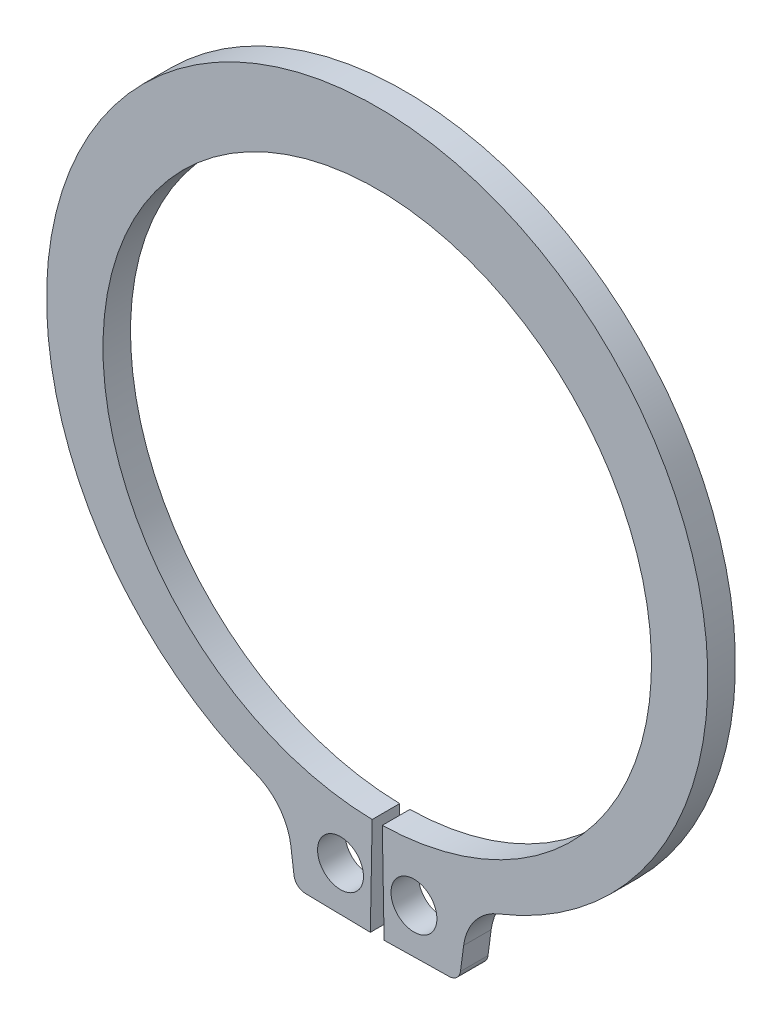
ISO-10303-21;
HEADER;
FILE_DESCRIPTION(('STEP AP214'),'2;1');
FILE_NAME('part.step','',(''),(''),'','','');
FILE_SCHEMA(('AUTOMOTIVE_DESIGN { 1 0 10303 214 1 1 1 1 }'));
ENDSEC;
DATA;
#1=APPLICATION_CONTEXT('core data for automotive mechanical design processes');
#2=APPLICATION_PROTOCOL_DEFINITION('international standard','automotive_design',2000,#1);
#3=PRODUCT_CONTEXT('',#1,'mechanical');
#4=PRODUCT('Part','Part','',(#3));
#5=PRODUCT_RELATED_PRODUCT_CATEGORY('part','',(#4));
#6=PRODUCT_DEFINITION_FORMATION('','',#4);
#7=PRODUCT_DEFINITION_CONTEXT('part definition',#1,'design');
#8=PRODUCT_DEFINITION('design','',#6,#7);
#9=PRODUCT_DEFINITION_SHAPE('','',#8);
#10=(LENGTH_UNIT() NAMED_UNIT(*) SI_UNIT(.MILLI.,.METRE.));
#11=(NAMED_UNIT(*) PLANE_ANGLE_UNIT() SI_UNIT($,.RADIAN.));
#12=(NAMED_UNIT(*) SI_UNIT($,.STERADIAN.) SOLID_ANGLE_UNIT());
#13=UNCERTAINTY_MEASURE_WITH_UNIT(LENGTH_MEASURE(1.E-05),#10,'distance_accuracy_value','');
#14=(GEOMETRIC_REPRESENTATION_CONTEXT(3) GLOBAL_UNCERTAINTY_ASSIGNED_CONTEXT((#13)) GLOBAL_UNIT_ASSIGNED_CONTEXT((#10,
#11,#12)) REPRESENTATION_CONTEXT('',''));
#15=CARTESIAN_POINT('',(0.,0.,0.));
#16=DIRECTION('',(0.,0.,1.));
#17=DIRECTION('',(1.,0.,0.));
#18=AXIS2_PLACEMENT_3D('',#15,#16,#17);
#19=CARTESIAN_POINT('',(0.,0.,-1.2));
#20=DIRECTION('',(0.,0.,1.));
#21=DIRECTION('',(1.,0.,0.));
#22=AXIS2_PLACEMENT_3D('',#19,#20,#21);
#23=CYLINDRICAL_SURFACE('',#22,11.95);
#24=CARTESIAN_POINT('',(0.,0.,0.));
#25=DIRECTION('',(0.,0.,-1.));
#26=DIRECTION('',(1.,0.,0.));
#27=AXIS2_PLACEMENT_3D('',#24,#25,#26);
#28=CIRCLE('',#27,11.95);
#29=CARTESIAN_POINT('',(-0.220615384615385,-11.9479633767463,0.));
#30=VERTEX_POINT('',#29);
#31=CARTESIAN_POINT('',(0.220615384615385,-11.9479633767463,0.));
#32=VERTEX_POINT('',#31);
#33=EDGE_CURVE('E151',#30,#32,#28,.T.);
#34=ORIENTED_EDGE('',*,*,#33,.F.);
#35=DIRECTION('',(0.,0.,1.));
#36=VECTOR('',#35,1.);
#37=CARTESIAN_POINT('',(-0.220615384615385,-11.9479633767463,-1.2));
#38=LINE('',#37,#36);
#39=CARTESIAN_POINT('',(-0.220615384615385,-11.9479633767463,-1.2));
#40=VERTEX_POINT('',#39);
#41=EDGE_CURVE('E11',#40,#30,#38,.T.);
#42=ORIENTED_EDGE('',*,*,#41,.F.);
#43=CARTESIAN_POINT('',(0.,0.,-1.2));
#44=DIRECTION('',(0.,0.,-1.));
#45=DIRECTION('',(1.,0.,0.));
#46=AXIS2_PLACEMENT_3D('',#43,#44,#45);
#47=CIRCLE('',#46,11.95);
#48=CARTESIAN_POINT('',(0.220615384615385,-11.9479633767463,-1.2));
#49=VERTEX_POINT('',#48);
#50=EDGE_CURVE('E184',#40,#49,#47,.T.);
#51=ORIENTED_EDGE('',*,*,#50,.T.);
#52=DIRECTION('',(0.,0.,1.));
#53=VECTOR('',#52,1.);
#54=CARTESIAN_POINT('',(0.220615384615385,-11.9479633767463,-1.2));
#55=LINE('',#54,#53);
#56=EDGE_CURVE('E33',#49,#32,#55,.T.);
#57=ORIENTED_EDGE('',*,*,#56,.T.);
#58=EDGE_LOOP('',(#34,#42,#51,#57));
#59=FACE_BOUND('',#58,.T.);
#60=ADVANCED_FACE('F30',(#59),#23,.F.);
#61=CARTESIAN_POINT('',(-0.220615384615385,-11.9479633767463,-1.2));
#62=DIRECTION('',(0.999829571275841,-0.0184615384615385,0.));
#63=DIRECTION('',(0.0184615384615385,0.999829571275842,0.));
#64=AXIS2_PLACEMENT_3D('',#61,#62,#63);
#65=PLANE('',#64);
#66=DIRECTION('',(0.0184615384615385,0.999829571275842,0.));
#67=VECTOR('',#66,1.);
#68=CARTESIAN_POINT('',(-0.220615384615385,-11.9479633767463,0.));
#69=LINE('',#68,#67);
#70=CARTESIAN_POINT('',(-0.3,-16.2472305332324,0.));
#71=VERTEX_POINT('',#70);
#72=EDGE_CURVE('E182',#71,#30,#69,.T.);
#73=ORIENTED_EDGE('',*,*,#72,.F.);
#74=DIRECTION('',(0.,0.,1.));
#75=VECTOR('',#74,1.);
#76=CARTESIAN_POINT('',(-0.3,-16.2472305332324,-1.2));
#77=LINE('',#76,#75);
#78=CARTESIAN_POINT('',(-0.3,-16.2472305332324,-1.2));
#79=VERTEX_POINT('',#78);
#80=EDGE_CURVE('E39',#79,#71,#77,.T.);
#81=ORIENTED_EDGE('',*,*,#80,.F.);
#82=DIRECTION('',(0.0184615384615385,0.999829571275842,0.));
#83=VECTOR('',#82,1.);
#84=CARTESIAN_POINT('',(-0.220615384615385,-11.9479633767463,-1.2));
#85=LINE('',#84,#83);
#86=EDGE_CURVE('E141',#79,#40,#85,.T.);
#87=ORIENTED_EDGE('',*,*,#86,.T.);
#88=ORIENTED_EDGE('',*,*,#41,.T.);
#89=EDGE_LOOP('',(#73,#81,#87,#88));
#90=FACE_BOUND('',#89,.T.);
#91=ADVANCED_FACE('F204',(#90),#65,.T.);
#92=CARTESIAN_POINT('',(-0.3,-16.2472305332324,-1.2));
#93=DIRECTION('',(-0.0184615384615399,-0.999829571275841,0.));
#94=DIRECTION('',(0.999829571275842,-0.0184615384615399,0.));
#95=AXIS2_PLACEMENT_3D('',#92,#93,#94);
#96=PLANE('',#95);
#97=DIRECTION('',(0.999829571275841,-0.0184615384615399,0.));
#98=VECTOR('',#97,1.);
#99=CARTESIAN_POINT('',(-0.3,-16.2472305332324,0.));
#100=LINE('',#99,#98);
#101=CARTESIAN_POINT('',(-3.13998163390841,-16.1947911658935,0.));
#102=VERTEX_POINT('',#101);
#103=EDGE_CURVE('E128',#102,#71,#100,.T.);
#104=ORIENTED_EDGE('',*,*,#103,.F.);
#105=DIRECTION('',(0.,0.,1.));
#106=VECTOR('',#105,1.);
#107=CARTESIAN_POINT('',(-3.13998163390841,-16.1947911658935,-1.2));
#108=LINE('',#107,#106);
#109=CARTESIAN_POINT('',(-3.13998163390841,-16.1947911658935,-1.2));
#110=VERTEX_POINT('',#109);
#111=EDGE_CURVE('E123',#110,#102,#108,.T.);
#112=ORIENTED_EDGE('',*,*,#111,.F.);
#113=DIRECTION('',(0.999829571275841,-0.0184615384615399,0.));
#114=VECTOR('',#113,1.);
#115=CARTESIAN_POINT('',(-0.3,-16.2472305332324,-1.2));
#116=LINE('',#115,#114);
#117=EDGE_CURVE('E126',#110,#79,#116,.T.);
#118=ORIENTED_EDGE('',*,*,#117,.T.);
#119=ORIENTED_EDGE('',*,*,#80,.T.);
#120=EDGE_LOOP('',(#104,#112,#118,#119));
#121=FACE_BOUND('',#120,.T.);
#122=ADVANCED_FACE('F125',(#121),#96,.T.);
#123=CARTESIAN_POINT('',(-3.13075086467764,-15.6948763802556,-1.2));
#124=DIRECTION('',(0.,0.,1.));
#125=DIRECTION('',(1.,0.,0.));
#126=AXIS2_PLACEMENT_3D('',#123,#124,#125);
#127=CYLINDRICAL_SURFACE('',#126,0.499999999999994);
#128=CARTESIAN_POINT('',(-3.13075086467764,-15.6948763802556,0.));
#129=DIRECTION('',(0.,0.,1.));
#130=DIRECTION('',(1.,0.,0.));
#131=AXIS2_PLACEMENT_3D('',#128,#129,#130);
#132=CIRCLE('',#131,0.499999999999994);
#133=CARTESIAN_POINT('',(-3.62647329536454,-15.7601394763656,0.));
#134=VERTEX_POINT('',#133);
#135=EDGE_CURVE('E179',#134,#102,#132,.T.);
#136=ORIENTED_EDGE('',*,*,#135,.F.);
#137=DIRECTION('',(0.,0.,1.));
#138=VECTOR('',#137,1.);
#139=CARTESIAN_POINT('',(-3.62647329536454,-15.7601394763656,-1.2));
#140=LINE('',#139,#138);
#141=CARTESIAN_POINT('',(-3.62647329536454,-15.7601394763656,-1.2));
#142=VERTEX_POINT('',#141);
#143=EDGE_CURVE('E133',#142,#134,#140,.T.);
#144=ORIENTED_EDGE('',*,*,#143,.F.);
#145=CARTESIAN_POINT('',(-3.13075086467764,-15.6948763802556,-1.2));
#146=DIRECTION('',(0.,0.,1.));
#147=DIRECTION('',(1.,0.,0.));
#148=AXIS2_PLACEMENT_3D('',#145,#146,#147);
#149=CIRCLE('',#148,0.499999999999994);
#150=EDGE_CURVE('E139',#142,#110,#149,.T.);
#151=ORIENTED_EDGE('',*,*,#150,.T.);
#152=ORIENTED_EDGE('',*,*,#111,.T.);
#153=EDGE_LOOP('',(#136,#144,#151,#152));
#154=FACE_BOUND('',#153,.T.);
#155=ADVANCED_FACE('F143',(#154),#127,.T.);
#156=CARTESIAN_POINT('',(-3.76485637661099,-14.7090156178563,-1.2));
#157=DIRECTION('',(-0.99144486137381,-0.130526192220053,0.));
#158=DIRECTION('',(0.130526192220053,-0.99144486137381,0.));
#159=AXIS2_PLACEMENT_3D('',#156,#157,#158);
#160=PLANE('',#159);
#161=DIRECTION('',(0.130526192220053,-0.99144486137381,0.));
#162=VECTOR('',#161,1.);
#163=CARTESIAN_POINT('',(-3.76485637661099,-14.7090156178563,0.));
#164=LINE('',#163,#162);
#165=CARTESIAN_POINT('',(-3.76485637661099,-14.7090156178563,0.));
#166=VERTEX_POINT('',#165);
#167=EDGE_CURVE('E176',#166,#134,#164,.T.);
#168=ORIENTED_EDGE('',*,*,#167,.F.);
#169=DIRECTION('',(0.,0.,1.));
#170=VECTOR('',#169,1.);
#171=CARTESIAN_POINT('',(-3.76485637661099,-14.7090156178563,-1.2));
#172=LINE('',#171,#170);
#173=CARTESIAN_POINT('',(-3.76485637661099,-14.7090156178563,-1.2));
#174=VERTEX_POINT('',#173);
#175=EDGE_CURVE('E188',#174,#166,#172,.T.);
#176=ORIENTED_EDGE('',*,*,#175,.F.);
#177=DIRECTION('',(0.130526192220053,-0.99144486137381,0.));
#178=VECTOR('',#177,1.);
#179=CARTESIAN_POINT('',(-3.76485637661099,-14.7090156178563,-1.2));
#180=LINE('',#179,#178);
#181=EDGE_CURVE('E144',#174,#142,#180,.T.);
#182=ORIENTED_EDGE('',*,*,#181,.T.);
#183=ORIENTED_EDGE('',*,*,#143,.T.);
#184=EDGE_LOOP('',(#168,#176,#182,#183));
#185=FACE_BOUND('',#184,.T.);
#186=ADVANCED_FACE('F217',(#185),#160,.T.);
#187=CARTESIAN_POINT('',(-6.18368330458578,-15.0274602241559,-1.2));
#188=DIRECTION('',(0.,0.,1.));
#189=DIRECTION('',(1.,0.,0.));
#190=AXIS2_PLACEMENT_3D('',#187,#188,#189);
#191=CYLINDRICAL_SURFACE('',#190,2.43969889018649);
#192=CARTESIAN_POINT('',(-6.18368330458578,-15.0274602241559,0.));
#193=DIRECTION('',(0.,0.,-1.));
#194=DIRECTION('',(1.,0.,0.));
#195=AXIS2_PLACEMENT_3D('',#192,#193,#194);
#196=CIRCLE('',#195,2.43969889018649);
#197=CARTESIAN_POINT('',(-5.28816881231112,-12.7580584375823,0.));
#198=VERTEX_POINT('',#197);
#199=EDGE_CURVE('E173',#198,#166,#196,.T.);
#200=ORIENTED_EDGE('',*,*,#199,.F.);
#201=DIRECTION('',(0.,0.,1.));
#202=VECTOR('',#201,1.);
#203=CARTESIAN_POINT('',(-5.28816881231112,-12.7580584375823,-1.2));
#204=LINE('',#203,#202);
#205=CARTESIAN_POINT('',(-5.28816881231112,-12.7580584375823,-1.2));
#206=VERTEX_POINT('',#205);
#207=EDGE_CURVE('E190',#206,#198,#204,.T.);
#208=ORIENTED_EDGE('',*,*,#207,.F.);
#209=CARTESIAN_POINT('',(-6.18368330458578,-15.0274602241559,-1.2));
#210=DIRECTION('',(0.,0.,-1.));
#211=DIRECTION('',(1.,0.,0.));
#212=AXIS2_PLACEMENT_3D('',#209,#210,#211);
#213=CIRCLE('',#212,2.43969889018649);
#214=EDGE_CURVE('E146',#206,#174,#213,.T.);
#215=ORIENTED_EDGE('',*,*,#214,.T.);
#216=ORIENTED_EDGE('',*,*,#175,.T.);
#217=EDGE_LOOP('',(#200,#208,#215,#216));
#218=FACE_BOUND('',#217,.T.);
#219=ADVANCED_FACE('F220',(#218),#191,.F.);
#220=CARTESIAN_POINT('',(0.,0.643153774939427,-1.2));
#221=DIRECTION('',(0.,0.,1.));
#222=DIRECTION('',(1.,0.,0.));
#223=AXIS2_PLACEMENT_3D('',#220,#221,#222);
#224=CYLINDRICAL_SURFACE('',#223,14.4068462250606);
#225=CARTESIAN_POINT('',(0.,0.643153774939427,0.));
#226=DIRECTION('',(0.,0.,1.));
#227=DIRECTION('',(1.,0.,0.));
#228=AXIS2_PLACEMENT_3D('',#225,#226,#227);
#229=CIRCLE('',#228,14.4068462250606);
#230=CARTESIAN_POINT('',(5.28816881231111,-12.7580584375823,0.));
#231=VERTEX_POINT('',#230);
#232=EDGE_CURVE('E170',#231,#198,#229,.T.);
#233=ORIENTED_EDGE('',*,*,#232,.F.);
#234=DIRECTION('',(0.,0.,1.));
#235=VECTOR('',#234,1.);
#236=CARTESIAN_POINT('',(5.28816881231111,-12.7580584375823,-1.2));
#237=LINE('',#236,#235);
#238=CARTESIAN_POINT('',(5.28816881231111,-12.7580584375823,-1.2));
#239=VERTEX_POINT('',#238);
#240=EDGE_CURVE('E192',#239,#231,#237,.T.);
#241=ORIENTED_EDGE('',*,*,#240,.F.);
#242=CARTESIAN_POINT('',(0.,0.643153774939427,-1.2));
#243=DIRECTION('',(0.,0.,1.));
#244=DIRECTION('',(1.,0.,0.));
#245=AXIS2_PLACEMENT_3D('',#242,#243,#244);
#246=CIRCLE('',#245,14.4068462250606);
#247=EDGE_CURVE('E294',#239,#206,#246,.T.);
#248=ORIENTED_EDGE('',*,*,#247,.T.);
#249=ORIENTED_EDGE('',*,*,#207,.T.);
#250=EDGE_LOOP('',(#233,#241,#248,#249));
#251=FACE_BOUND('',#250,.T.);
#252=ADVANCED_FACE('F224',(#251),#224,.T.);
#253=CARTESIAN_POINT('',(6.18368330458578,-15.0274602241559,-1.2));
#254=DIRECTION('',(0.,0.,1.));
#255=DIRECTION('',(1.,0.,0.));
#256=AXIS2_PLACEMENT_3D('',#253,#254,#255);
#257=CYLINDRICAL_SURFACE('',#256,2.43969889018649);
#258=CARTESIAN_POINT('',(6.18368330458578,-15.0274602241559,0.));
#259=DIRECTION('',(0.,0.,-1.));
#260=DIRECTION('',(1.,0.,0.));
#261=AXIS2_PLACEMENT_3D('',#258,#259,#260);
#262=CIRCLE('',#261,2.43969889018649);
#263=CARTESIAN_POINT('',(3.76485637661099,-14.7090156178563,0.));
#264=VERTEX_POINT('',#263);
#265=EDGE_CURVE('E167',#264,#231,#262,.T.);
#266=ORIENTED_EDGE('',*,*,#265,.F.);
#267=DIRECTION('',(0.,0.,1.));
#268=VECTOR('',#267,1.);
#269=CARTESIAN_POINT('',(3.76485637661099,-14.7090156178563,-1.2));
#270=LINE('',#269,#268);
#271=CARTESIAN_POINT('',(3.76485637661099,-14.7090156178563,-1.2));
#272=VERTEX_POINT('',#271);
#273=EDGE_CURVE('E194',#272,#264,#270,.T.);
#274=ORIENTED_EDGE('',*,*,#273,.F.);
#275=CARTESIAN_POINT('',(6.18368330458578,-15.0274602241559,-1.2));
#276=DIRECTION('',(0.,0.,-1.));
#277=DIRECTION('',(1.,0.,0.));
#278=AXIS2_PLACEMENT_3D('',#275,#276,#277);
#279=CIRCLE('',#278,2.43969889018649);
#280=EDGE_CURVE('E291',#272,#239,#279,.T.);
#281=ORIENTED_EDGE('',*,*,#280,.T.);
#282=ORIENTED_EDGE('',*,*,#240,.T.);
#283=EDGE_LOOP('',(#266,#274,#281,#282));
#284=FACE_BOUND('',#283,.T.);
#285=ADVANCED_FACE('F228',(#284),#257,.F.);
#286=CARTESIAN_POINT('',(3.76485637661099,-14.7090156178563,-1.2));
#287=DIRECTION('',(0.99144486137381,-0.130526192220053,0.));
#288=DIRECTION('',(0.130526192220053,0.99144486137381,0.));
#289=AXIS2_PLACEMENT_3D('',#286,#287,#288);
#290=PLANE('',#289);
#291=DIRECTION('',(0.130526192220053,0.99144486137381,0.));
#292=VECTOR('',#291,1.);
#293=CARTESIAN_POINT('',(3.76485637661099,-14.7090156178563,0.));
#294=LINE('',#293,#292);
#295=CARTESIAN_POINT('',(3.62647329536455,-15.7601394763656,0.));
#296=VERTEX_POINT('',#295);
#297=EDGE_CURVE('E164',#296,#264,#294,.T.);
#298=ORIENTED_EDGE('',*,*,#297,.F.);
#299=DIRECTION('',(0.,0.,1.));
#300=VECTOR('',#299,1.);
#301=CARTESIAN_POINT('',(3.62647329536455,-15.7601394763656,-1.2));
#302=LINE('',#301,#300);
#303=CARTESIAN_POINT('',(3.62647329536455,-15.7601394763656,-1.2));
#304=VERTEX_POINT('',#303);
#305=EDGE_CURVE('E196',#304,#296,#302,.T.);
#306=ORIENTED_EDGE('',*,*,#305,.F.);
#307=DIRECTION('',(0.130526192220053,0.99144486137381,0.));
#308=VECTOR('',#307,1.);
#309=CARTESIAN_POINT('',(3.76485637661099,-14.7090156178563,-1.2));
#310=LINE('',#309,#308);
#311=EDGE_CURVE('E288',#304,#272,#310,.T.);
#312=ORIENTED_EDGE('',*,*,#311,.T.);
#313=ORIENTED_EDGE('',*,*,#273,.T.);
#314=EDGE_LOOP('',(#298,#306,#312,#313));
#315=FACE_BOUND('',#314,.T.);
#316=ADVANCED_FACE('F232',(#315),#290,.T.);
#317=CARTESIAN_POINT('',(3.13075086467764,-15.6948763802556,-1.2));
#318=DIRECTION('',(0.,0.,1.));
#319=DIRECTION('',(1.,0.,0.));
#320=AXIS2_PLACEMENT_3D('',#317,#318,#319);
#321=CYLINDRICAL_SURFACE('',#320,0.499999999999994);
#322=CARTESIAN_POINT('',(3.13075086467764,-15.6948763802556,0.));
#323=DIRECTION('',(0.,0.,1.));
#324=DIRECTION('',(-1.,0.,0.));
#325=AXIS2_PLACEMENT_3D('',#322,#323,#324);
#326=CIRCLE('',#325,0.499999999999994);
#327=CARTESIAN_POINT('',(3.13998163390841,-16.1947911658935,0.));
#328=VERTEX_POINT('',#327);
#329=EDGE_CURVE('E161',#328,#296,#326,.T.);
#330=ORIENTED_EDGE('',*,*,#329,.F.);
#331=DIRECTION('',(0.,0.,1.));
#332=VECTOR('',#331,1.);
#333=CARTESIAN_POINT('',(3.13998163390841,-16.1947911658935,-1.2));
#334=LINE('',#333,#332);
#335=CARTESIAN_POINT('',(3.13998163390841,-16.1947911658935,-1.2));
#336=VERTEX_POINT('',#335);
#337=EDGE_CURVE('E198',#336,#328,#334,.T.);
#338=ORIENTED_EDGE('',*,*,#337,.F.);
#339=CARTESIAN_POINT('',(3.13075086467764,-15.6948763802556,-1.2));
#340=DIRECTION('',(0.,0.,1.));
#341=DIRECTION('',(-1.,0.,0.));
#342=AXIS2_PLACEMENT_3D('',#339,#340,#341);
#343=CIRCLE('',#342,0.499999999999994);
#344=EDGE_CURVE('E285',#336,#304,#343,.T.);
#345=ORIENTED_EDGE('',*,*,#344,.T.);
#346=ORIENTED_EDGE('',*,*,#305,.T.);
#347=EDGE_LOOP('',(#330,#338,#345,#346));
#348=FACE_BOUND('',#347,.T.);
#349=ADVANCED_FACE('F236',(#348),#321,.T.);
#350=CARTESIAN_POINT('',(0.3,-16.2472305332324,-1.2));
#351=DIRECTION('',(0.0184615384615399,-0.999829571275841,0.));
#352=DIRECTION('',(0.999829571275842,0.0184615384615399,0.));
#353=AXIS2_PLACEMENT_3D('',#350,#351,#352);
#354=PLANE('',#353);
#355=DIRECTION('',(0.999829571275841,0.0184615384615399,0.));
#356=VECTOR('',#355,1.);
#357=CARTESIAN_POINT('',(0.3,-16.2472305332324,0.));
#358=LINE('',#357,#356);
#359=CARTESIAN_POINT('',(0.3,-16.2472305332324,0.));
#360=VERTEX_POINT('',#359);
#361=EDGE_CURVE('E158',#360,#328,#358,.T.);
#362=ORIENTED_EDGE('',*,*,#361,.F.);
#363=DIRECTION('',(0.,0.,1.));
#364=VECTOR('',#363,1.);
#365=CARTESIAN_POINT('',(0.3,-16.2472305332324,-1.2));
#366=LINE('',#365,#364);
#367=CARTESIAN_POINT('',(0.3,-16.2472305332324,-1.2));
#368=VERTEX_POINT('',#367);
#369=EDGE_CURVE('E199',#368,#360,#366,.T.);
#370=ORIENTED_EDGE('',*,*,#369,.F.);
#371=DIRECTION('',(0.999829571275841,0.0184615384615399,0.));
#372=VECTOR('',#371,1.);
#373=CARTESIAN_POINT('',(0.3,-16.2472305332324,-1.2));
#374=LINE('',#373,#372);
#375=EDGE_CURVE('E282',#368,#336,#374,.T.);
#376=ORIENTED_EDGE('',*,*,#375,.T.);
#377=ORIENTED_EDGE('',*,*,#337,.T.);
#378=EDGE_LOOP('',(#362,#370,#376,#377));
#379=FACE_BOUND('',#378,.T.);
#380=ADVANCED_FACE('F240',(#379),#354,.T.);
#381=CARTESIAN_POINT('',(0.220615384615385,-11.9479633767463,-1.2));
#382=DIRECTION('',(-0.999829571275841,-0.0184615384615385,0.));
#383=DIRECTION('',(0.0184615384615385,-0.999829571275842,0.));
#384=AXIS2_PLACEMENT_3D('',#381,#382,#383);
#385=PLANE('',#384);
#386=DIRECTION('',(0.0184615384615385,-0.999829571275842,0.));
#387=VECTOR('',#386,1.);
#388=CARTESIAN_POINT('',(0.220615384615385,-11.9479633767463,0.));
#389=LINE('',#388,#387);
#390=EDGE_CURVE('E154',#32,#360,#389,.T.);
#391=ORIENTED_EDGE('',*,*,#390,.F.);
#392=ORIENTED_EDGE('',*,*,#56,.F.);
#393=DIRECTION('',(0.0184615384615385,-0.999829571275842,0.));
#394=VECTOR('',#393,1.);
#395=CARTESIAN_POINT('',(0.220615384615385,-11.9479633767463,-1.2));
#396=LINE('',#395,#394);
#397=EDGE_CURVE('E280',#49,#368,#396,.T.);
#398=ORIENTED_EDGE('',*,*,#397,.T.);
#399=ORIENTED_EDGE('',*,*,#369,.T.);
#400=EDGE_LOOP('',(#391,#392,#398,#399));
#401=FACE_BOUND('',#400,.T.);
#402=ADVANCED_FACE('F201',(#401),#385,.T.);
#403=CARTESIAN_POINT('',(0.,0.,-1.2));
#404=DIRECTION('',(0.,0.,1.));
#405=DIRECTION('',(1.,0.,0.));
#406=AXIS2_PLACEMENT_3D('',#403,#404,#405);
#407=PLANE('',#406);
#408=CARTESIAN_POINT('',(-1.6,-14.2856790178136,-1.2));
#409=DIRECTION('',(0.,0.,1.));
#410=DIRECTION('',(1.,0.,0.));
#411=AXIS2_PLACEMENT_3D('',#408,#409,#410);
#412=CIRCLE('',#411,1.);
#413=CARTESIAN_POINT('',(-0.6,-14.2856790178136,-1.2));
#414=VERTEX_POINT('',#413);
#415=EDGE_CURVE('E267',#414,#414,#412,.T.);
#416=ORIENTED_EDGE('',*,*,#415,.T.);
#417=EDGE_LOOP('',(#416));
#418=FACE_BOUND('',#417,.T.);
#419=CARTESIAN_POINT('',(1.6,-14.2856790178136,-1.2));
#420=DIRECTION('',(0.,0.,1.));
#421=DIRECTION('',(1.,0.,0.));
#422=AXIS2_PLACEMENT_3D('',#419,#420,#421);
#423=CIRCLE('',#422,1.);
#424=CARTESIAN_POINT('',(2.6,-14.2856790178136,-1.2));
#425=VERTEX_POINT('',#424);
#426=EDGE_CURVE('E155',#425,#425,#423,.T.);
#427=ORIENTED_EDGE('',*,*,#426,.T.);
#428=EDGE_LOOP('',(#427));
#429=FACE_BOUND('',#428,.T.);
#430=ORIENTED_EDGE('',*,*,#50,.F.);
#431=ORIENTED_EDGE('',*,*,#86,.F.);
#432=ORIENTED_EDGE('',*,*,#117,.F.);
#433=ORIENTED_EDGE('',*,*,#150,.F.);
#434=ORIENTED_EDGE('',*,*,#181,.F.);
#435=ORIENTED_EDGE('',*,*,#214,.F.);
#436=ORIENTED_EDGE('',*,*,#247,.F.);
#437=ORIENTED_EDGE('',*,*,#280,.F.);
#438=ORIENTED_EDGE('',*,*,#311,.F.);
#439=ORIENTED_EDGE('',*,*,#344,.F.);
#440=ORIENTED_EDGE('',*,*,#375,.F.);
#441=ORIENTED_EDGE('',*,*,#397,.F.);
#442=EDGE_LOOP('',(#430,#431,#432,#433,#434,#435,#436,#437,#438,#439,#440,#441));
#443=FACE_BOUND('',#442,.T.);
#444=ADVANCED_FACE('F137',(#418,#429,#443),#407,.F.);
#445=CARTESIAN_POINT('',(0.,0.,0.));
#446=DIRECTION('',(0.,0.,1.));
#447=DIRECTION('',(1.,0.,0.));
#448=AXIS2_PLACEMENT_3D('',#445,#446,#447);
#449=PLANE('',#448);
#450=CARTESIAN_POINT('',(-1.6,-14.2856790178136,0.));
#451=DIRECTION('',(0.,0.,1.));
#452=DIRECTION('',(1.,0.,0.));
#453=AXIS2_PLACEMENT_3D('',#450,#451,#452);
#454=CIRCLE('',#453,1.);
#455=CARTESIAN_POINT('',(-0.6,-14.2856790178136,0.));
#456=VERTEX_POINT('',#455);
#457=EDGE_CURVE('E270',#456,#456,#454,.T.);
#458=ORIENTED_EDGE('',*,*,#457,.F.);
#459=EDGE_LOOP('',(#458));
#460=FACE_BOUND('',#459,.T.);
#461=CARTESIAN_POINT('',(1.6,-14.2856790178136,0.));
#462=DIRECTION('',(0.,0.,1.));
#463=DIRECTION('',(1.,0.,0.));
#464=AXIS2_PLACEMENT_3D('',#461,#462,#463);
#465=CIRCLE('',#464,1.);
#466=CARTESIAN_POINT('',(2.6,-14.2856790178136,0.));
#467=VERTEX_POINT('',#466);
#468=EDGE_CURVE('E272',#467,#467,#465,.T.);
#469=ORIENTED_EDGE('',*,*,#468,.F.);
#470=EDGE_LOOP('',(#469));
#471=FACE_BOUND('',#470,.T.);
#472=ORIENTED_EDGE('',*,*,#33,.T.);
#473=ORIENTED_EDGE('',*,*,#390,.T.);
#474=ORIENTED_EDGE('',*,*,#361,.T.);
#475=ORIENTED_EDGE('',*,*,#329,.T.);
#476=ORIENTED_EDGE('',*,*,#297,.T.);
#477=ORIENTED_EDGE('',*,*,#265,.T.);
#478=ORIENTED_EDGE('',*,*,#232,.T.);
#479=ORIENTED_EDGE('',*,*,#199,.T.);
#480=ORIENTED_EDGE('',*,*,#167,.T.);
#481=ORIENTED_EDGE('',*,*,#135,.T.);
#482=ORIENTED_EDGE('',*,*,#103,.T.);
#483=ORIENTED_EDGE('',*,*,#72,.T.);
#484=EDGE_LOOP('',(#472,#473,#474,#475,#476,#477,#478,#479,#480,#481,#482,#483));
#485=FACE_BOUND('',#484,.T.);
#486=ADVANCED_FACE('F203',(#460,#471,#485),#449,.T.);
#487=CARTESIAN_POINT('',(1.6,-14.2856790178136,-1.2));
#488=DIRECTION('',(0.,0.,1.));
#489=DIRECTION('',(1.,0.,0.));
#490=AXIS2_PLACEMENT_3D('',#487,#488,#489);
#491=CYLINDRICAL_SURFACE('',#490,1.);
#492=ORIENTED_EDGE('',*,*,#426,.F.);
#493=EDGE_LOOP('',(#492));
#494=FACE_BOUND('',#493,.T.);
#495=ORIENTED_EDGE('',*,*,#468,.T.);
#496=EDGE_LOOP('',(#495));
#497=FACE_BOUND('',#496,.T.);
#498=ADVANCED_FACE('F252',(#494,#497),#491,.F.);
#499=CARTESIAN_POINT('',(-1.6,-14.2856790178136,-1.2));
#500=DIRECTION('',(0.,0.,1.));
#501=DIRECTION('',(1.,0.,0.));
#502=AXIS2_PLACEMENT_3D('',#499,#500,#501);
#503=CYLINDRICAL_SURFACE('',#502,1.);
#504=ORIENTED_EDGE('',*,*,#415,.F.);
#505=EDGE_LOOP('',(#504));
#506=FACE_BOUND('',#505,.T.);
#507=ORIENTED_EDGE('',*,*,#457,.T.);
#508=EDGE_LOOP('',(#507));
#509=FACE_BOUND('',#508,.T.);
#510=ADVANCED_FACE('F259',(#506,#509),#503,.F.);
#511=CLOSED_SHELL('',(#60,#91,#122,#155,#186,#219,#252,#285,#316,#349,#380,#402,#444,#486,#498,#510));
#512=MANIFOLD_SOLID_BREP('B2',#511);
#513=ADVANCED_BREP_SHAPE_REPRESENTATION('',(#18,#512),#14);
#514=SHAPE_DEFINITION_REPRESENTATION(#9,#513);
ENDSEC;
END-ISO-10303-21;
